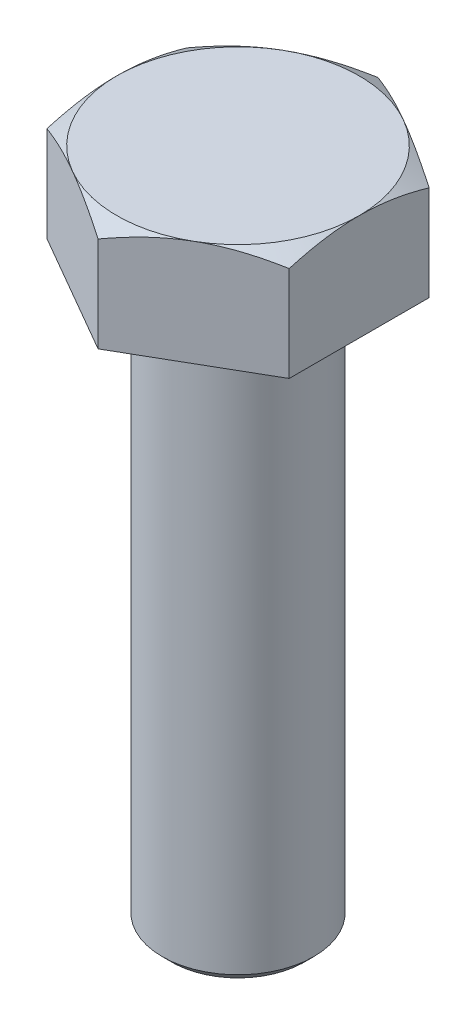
ISO-10303-21;
HEADER;
FILE_DESCRIPTION(('STEP AP214'),'2;1');
FILE_NAME('part.step','',(''),(''),'','','');
FILE_SCHEMA(('AUTOMOTIVE_DESIGN { 1 0 10303 214 1 1 1 1 }'));
ENDSEC;
DATA;
#1=APPLICATION_CONTEXT('core data for automotive mechanical design processes');
#2=APPLICATION_PROTOCOL_DEFINITION('international standard','automotive_design',2000,#1);
#3=PRODUCT_CONTEXT('',#1,'mechanical');
#4=PRODUCT('Part','Part','',(#3));
#5=PRODUCT_RELATED_PRODUCT_CATEGORY('part','',(#4));
#6=PRODUCT_DEFINITION_FORMATION('','',#4);
#7=PRODUCT_DEFINITION_CONTEXT('part definition',#1,'design');
#8=PRODUCT_DEFINITION('design','',#6,#7);
#9=PRODUCT_DEFINITION_SHAPE('','',#8);
#10=(LENGTH_UNIT() NAMED_UNIT(*) SI_UNIT(.MILLI.,.METRE.));
#11=(NAMED_UNIT(*) PLANE_ANGLE_UNIT() SI_UNIT($,.RADIAN.));
#12=(NAMED_UNIT(*) SI_UNIT($,.STERADIAN.) SOLID_ANGLE_UNIT());
#13=UNCERTAINTY_MEASURE_WITH_UNIT(LENGTH_MEASURE(1.E-05),#10,'distance_accuracy_value','');
#14=(GEOMETRIC_REPRESENTATION_CONTEXT(3) GLOBAL_UNCERTAINTY_ASSIGNED_CONTEXT((#13)) GLOBAL_UNIT_ASSIGNED_CONTEXT((#10,
#11,#12)) REPRESENTATION_CONTEXT('',''));
#15=CARTESIAN_POINT('',(0.,0.,0.));
#16=DIRECTION('',(0.,0.,1.));
#17=DIRECTION('',(1.,0.,0.));
#18=AXIS2_PLACEMENT_3D('',#15,#16,#17);
#19=CARTESIAN_POINT('',(0.,-60.,0.));
#20=DIRECTION('',(0.,1.,0.));
#21=DIRECTION('',(0.,0.,1.));
#22=AXIS2_PLACEMENT_3D('',#19,#20,#21);
#23=CYLINDRICAL_SURFACE('',#22,8.);
#24=CARTESIAN_POINT('',(0.,0.,0.));
#25=DIRECTION('',(0.,1.,0.));
#26=DIRECTION('',(0.,0.,1.));
#27=AXIS2_PLACEMENT_3D('',#24,#25,#26);
#28=CIRCLE('',#27,8.);
#29=CARTESIAN_POINT('',(0.,0.,8.));
#30=VERTEX_POINT('',#29);
#31=EDGE_CURVE('E246',#30,#30,#28,.F.);
#32=ORIENTED_EDGE('',*,*,#31,.T.);
#33=EDGE_LOOP('',(#32));
#34=FACE_BOUND('',#33,.T.);
#35=CARTESIAN_POINT('',(0.,-59.,0.));
#36=DIRECTION('',(0.,1.,0.));
#37=DIRECTION('',(0.,0.,1.));
#38=AXIS2_PLACEMENT_3D('',#35,#36,#37);
#39=CIRCLE('',#38,8.);
#40=CARTESIAN_POINT('',(0.,-59.,8.));
#41=VERTEX_POINT('',#40);
#42=EDGE_CURVE('E336',#41,#41,#39,.F.);
#43=ORIENTED_EDGE('',*,*,#42,.F.);
#44=EDGE_LOOP('',(#43));
#45=FACE_BOUND('',#44,.T.);
#46=ADVANCED_FACE('F38',(#34,#45),#23,.T.);
#47=CARTESIAN_POINT('',(12.8,11.2,-7.39008344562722));
#48=DIRECTION('',(-0.5,0.,0.866025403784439));
#49=DIRECTION('',(0.866025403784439,0.,0.5));
#50=AXIS2_PLACEMENT_3D('',#47,#48,#49);
#51=PLANE('',#50);
#52=CARTESIAN_POINT('',(12.8002,10.056683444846,-7.38996797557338));
#53=CARTESIAN_POINT('',(12.5188607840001,10.1504573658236,-7.55239924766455));
#54=CARTESIAN_POINT('',(12.2364241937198,10.2399760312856,-7.71546408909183));
#55=CARTESIAN_POINT('',(11.6692862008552,10.4093200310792,-8.04290136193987));
#56=CARTESIAN_POINT('',(11.3845840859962,10.4891421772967,-8.20727420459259));
#57=CARTESIAN_POINT('',(10.8123648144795,10.6380201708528,-8.53764515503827));
#58=CARTESIAN_POINT('',(10.5248426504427,10.7070505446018,-8.70364615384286));
#59=CARTESIAN_POINT('',(9.94780038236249,10.8328627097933,-9.03680166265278));
#60=CARTESIAN_POINT('',(9.65828039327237,10.8896452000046,-9.20395610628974));
#61=CARTESIAN_POINT('',(9.08466110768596,10.988546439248,-9.53513535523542));
#62=CARTESIAN_POINT('',(8.80060439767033,11.0309925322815,-9.69913557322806));
#63=CARTESIAN_POINT('',(8.23118936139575,11.1021653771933,-10.0278874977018));
#64=CARTESIAN_POINT('',(7.94583101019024,11.1308918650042,-10.1926392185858));
#65=CARTESIAN_POINT('',(7.37463493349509,11.1739001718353,-10.5224194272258));
#66=CARTESIAN_POINT('',(7.08879818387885,11.1881991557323,-10.687447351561));
#67=CARTESIAN_POINT('',(6.51686081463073,11.2020449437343,-11.0176555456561));
#68=CARTESIAN_POINT('',(6.2307602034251,11.2015922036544,-11.1828358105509));
#69=CARTESIAN_POINT('',(5.69589532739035,11.1869648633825,-11.4916401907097));
#70=CARTESIAN_POINT('',(5.44709294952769,11.1745744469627,-11.6352863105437));
#71=CARTESIAN_POINT('',(4.95006049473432,11.1388708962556,-11.9222481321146));
#72=CARTESIAN_POINT('',(4.70183045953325,11.1155569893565,-12.0655638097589));
#73=CARTESIAN_POINT('',(4.20607752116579,11.0584129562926,-12.3517869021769));
#74=CARTESIAN_POINT('',(3.95855537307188,11.0245741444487,-12.4946938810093));
#75=CARTESIAN_POINT('',(3.46467151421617,10.9469740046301,-12.7798378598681));
#76=CARTESIAN_POINT('',(3.21830988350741,10.903212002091,-12.9220748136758));
#77=CARTESIAN_POINT('',(2.47046538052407,10.7559349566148,-13.3538430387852));
#78=CARTESIAN_POINT('',(1.97114815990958,10.6377347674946,-13.642123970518));
#79=CARTESIAN_POINT('',(0.97995921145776,10.3694685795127,-14.2143871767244));
#80=CARTESIAN_POINT('',(0.488074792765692,10.2194655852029,-14.4983767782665));
#81=CARTESIAN_POINT('',(-0.000199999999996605,10.056683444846,-14.7802823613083));
#82=B_SPLINE_CURVE_WITH_KNOTS('',3,(#52,#53,#54,#55,#56,#57,#58,#59,#60,#61,#62,#63,#64,#65,#66,
#67,#68,#69,#70,#71,#72,#73,#74,#75,#76,#77,#78,#79,#80,#81),.UNSPECIFIED.,.F.,.F.,(4,2,2,2,2,2,
2,2,2,2,2,2,2,2,4),(0.,1.01440467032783,2.02914196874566,3.04623948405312,4.06327895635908,
5.05521538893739,6.04717091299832,7.03794487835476,8.02868822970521,8.89115821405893,
9.7536892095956,10.6169339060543,11.4802373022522,13.2448088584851,15.0059167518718),.UNSPECIFIED.);
#83=CARTESIAN_POINT('',(12.8,10.0567501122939,-7.39008344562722));
#84=VERTEX_POINT('',#83);
#85=CARTESIAN_POINT('',(6.40000000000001,11.2,-11.0851251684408));
#86=VERTEX_POINT('',#85);
#87=EDGE_CURVE('E109',#84,#86,#82,.T.);
#88=ORIENTED_EDGE('',*,*,#87,.F.);
#89=DIRECTION('',(0.,-1.,0.));
#90=VECTOR('',#89,1.);
#91=CARTESIAN_POINT('',(12.8,11.2,-7.39008344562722));
#92=LINE('',#91,#90);
#93=CARTESIAN_POINT('',(12.8,0.,-7.39008344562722));
#94=VERTEX_POINT('',#93);
#95=EDGE_CURVE('E241',#84,#94,#92,.T.);
#96=ORIENTED_EDGE('',*,*,#95,.T.);
#97=DIRECTION('',(-0.866025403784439,0.,-0.5));
#98=VECTOR('',#97,1.);
#99=CARTESIAN_POINT('',(12.8,0.,-7.39008344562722));
#100=LINE('',#99,#98);
#101=CARTESIAN_POINT('',(0.,0.,-14.7801668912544));
#102=VERTEX_POINT('',#101);
#103=EDGE_CURVE('E117',#94,#102,#100,.T.);
#104=ORIENTED_EDGE('',*,*,#103,.T.);
#105=DIRECTION('',(0.,-1.,0.));
#106=VECTOR('',#105,1.);
#107=CARTESIAN_POINT('',(0.,11.2,-14.7801668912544));
#108=LINE('',#107,#106);
#109=CARTESIAN_POINT('',(0.,10.0567501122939,-14.7801668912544));
#110=VERTEX_POINT('',#109);
#111=EDGE_CURVE('E132',#110,#102,#108,.T.);
#112=ORIENTED_EDGE('',*,*,#111,.F.);
#113=EDGE_CURVE('E118',#86,#110,#82,.T.);
#114=ORIENTED_EDGE('',*,*,#113,.F.);
#115=EDGE_LOOP('',(#88,#96,#104,#112,#114));
#116=FACE_BOUND('',#115,.T.);
#117=ADVANCED_FACE('F40',(#116),#51,.F.);
#118=CARTESIAN_POINT('',(0.,11.2,-14.7801668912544));
#119=DIRECTION('',(0.5,0.,0.866025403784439));
#120=DIRECTION('',(0.866025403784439,0.,-0.5));
#121=AXIS2_PLACEMENT_3D('',#118,#119,#120);
#122=PLANE('',#121);
#123=CARTESIAN_POINT('',(0.000200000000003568,10.056683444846,-14.7802823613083));
#124=CARTESIAN_POINT('',(-0.281139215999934,10.1504573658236,-14.6178510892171));
#125=CARTESIAN_POINT('',(-0.563575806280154,10.2399760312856,-14.4547862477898));
#126=CARTESIAN_POINT('',(-1.13071379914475,10.4093200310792,-14.1273489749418));
#127=CARTESIAN_POINT('',(-1.41541591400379,10.4891421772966,-13.9629761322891));
#128=CARTESIAN_POINT('',(-1.98763518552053,10.6380201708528,-13.6326051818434));
#129=CARTESIAN_POINT('',(-2.27515734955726,10.7070505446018,-13.4666041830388));
#130=CARTESIAN_POINT('',(-2.85219961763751,10.8328627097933,-13.1334486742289));
#131=CARTESIAN_POINT('',(-3.14171960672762,10.8896452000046,-12.9662942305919));
#132=CARTESIAN_POINT('',(-3.71533889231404,10.988546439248,-12.6351149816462));
#133=CARTESIAN_POINT('',(-3.99939560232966,11.0309925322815,-12.4711147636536));
#134=CARTESIAN_POINT('',(-4.56881063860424,11.1021653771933,-12.1423628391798));
#135=CARTESIAN_POINT('',(-4.85416898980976,11.1308918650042,-11.9776111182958));
#136=CARTESIAN_POINT('',(-5.4253650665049,11.1739001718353,-11.6478309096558));
#137=CARTESIAN_POINT('',(-5.71120181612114,11.1881991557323,-11.4828029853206));
#138=CARTESIAN_POINT('',(-6.28313918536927,11.2020449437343,-11.1525947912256));
#139=CARTESIAN_POINT('',(-6.5692397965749,11.2015922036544,-10.9874145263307));
#140=CARTESIAN_POINT('',(-7.10410467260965,11.1869648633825,-10.678610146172));
#141=CARTESIAN_POINT('',(-7.3529070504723,11.1745744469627,-10.5349640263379));
#142=CARTESIAN_POINT('',(-7.84993950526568,11.1388708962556,-10.248002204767));
#143=CARTESIAN_POINT('',(-8.09816954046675,11.1155569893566,-10.1046865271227));
#144=CARTESIAN_POINT('',(-8.59392247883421,11.0584129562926,-9.81846343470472));
#145=CARTESIAN_POINT('',(-8.84144462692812,11.0245741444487,-9.67555645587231));
#146=CARTESIAN_POINT('',(-9.33532848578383,10.9469740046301,-9.39041247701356));
#147=CARTESIAN_POINT('',(-9.58169011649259,10.903212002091,-9.24817552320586));
#148=CARTESIAN_POINT('',(-10.3295346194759,10.7559349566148,-8.81640729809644));
#149=CARTESIAN_POINT('',(-10.8288518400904,10.6377347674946,-8.52812636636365));
#150=CARTESIAN_POINT('',(-11.8200407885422,10.3694685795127,-7.95586316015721));
#151=CARTESIAN_POINT('',(-12.3119252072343,10.2194655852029,-7.67187355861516));
#152=CARTESIAN_POINT('',(-12.8002,10.056683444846,-7.38996797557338));
#153=B_SPLINE_CURVE_WITH_KNOTS('',3,(#123,#124,#125,#126,#127,#128,#129,#130,#131,#132,#133,
#134,#135,#136,#137,#138,#139,#140,#141,#142,#143,#144,#145,#146,#147,#148,#149,#150,#151,#152),
.UNSPECIFIED.,.F.,.F.,(4,2,2,2,2,2,2,2,2,2,2,2,2,2,4),(0.,1.01440467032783,2.02914196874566,
3.04623948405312,4.06327895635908,5.05521538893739,6.04717091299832,7.03794487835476,
8.02868822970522,8.89115821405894,9.7536892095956,10.6169339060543,11.4802373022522,
13.2448088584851,15.0059167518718),.UNSPECIFIED.);
#154=CARTESIAN_POINT('',(-6.4,11.2,-11.0851251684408));
#155=VERTEX_POINT('',#154);
#156=EDGE_CURVE('E124',#110,#155,#153,.T.);
#157=ORIENTED_EDGE('',*,*,#156,.F.);
#158=ORIENTED_EDGE('',*,*,#111,.T.);
#159=DIRECTION('',(-0.866025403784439,0.,0.5));
#160=VECTOR('',#159,1.);
#161=CARTESIAN_POINT('',(0.,0.,-14.7801668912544));
#162=LINE('',#161,#160);
#163=CARTESIAN_POINT('',(-12.8,0.,-7.39008344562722));
#164=VERTEX_POINT('',#163);
#165=EDGE_CURVE('E281',#102,#164,#162,.T.);
#166=ORIENTED_EDGE('',*,*,#165,.T.);
#167=DIRECTION('',(0.,-1.,0.));
#168=VECTOR('',#167,1.);
#169=CARTESIAN_POINT('',(-12.8,11.2,-7.39008344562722));
#170=LINE('',#169,#168);
#171=CARTESIAN_POINT('',(-12.8,10.0567501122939,-7.39008344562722));
#172=VERTEX_POINT('',#171);
#173=EDGE_CURVE('E239',#172,#164,#170,.T.);
#174=ORIENTED_EDGE('',*,*,#173,.F.);
#175=EDGE_CURVE('E133',#155,#172,#153,.T.);
#176=ORIENTED_EDGE('',*,*,#175,.F.);
#177=EDGE_LOOP('',(#157,#158,#166,#174,#176));
#178=FACE_BOUND('',#177,.T.);
#179=ADVANCED_FACE('F187',(#178),#122,.F.);
#180=CARTESIAN_POINT('',(-12.8,11.2,-7.39008344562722));
#181=DIRECTION('',(1.,0.,0.));
#182=DIRECTION('',(0.,0.,-1.));
#183=AXIS2_PLACEMENT_3D('',#180,#181,#182);
#184=PLANE('',#183);
#185=CARTESIAN_POINT('',(-12.8,4.77136237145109,-20.2245186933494));
#186=CARTESIAN_POINT('',(-12.8,4.90853193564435,-19.9433435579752));
#187=CARTESIAN_POINT('',(-12.8,5.04504514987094,-19.6618483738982));
#188=CARTESIAN_POINT('',(-12.8,5.31661090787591,-19.0981512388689));
#189=CARTESIAN_POINT('',(-12.8,5.45166343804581,-18.815949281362));
#190=CARTESIAN_POINT('',(-12.8,5.85444132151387,-17.9681130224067));
#191=CARTESIAN_POINT('',(-12.8,6.11974898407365,-17.4013259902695));
#192=CARTESIAN_POINT('',(-12.8,6.6437309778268,-16.2611725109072));
#193=CARTESIAN_POINT('',(-12.8,6.9023644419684,-15.6877872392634));
#194=CARTESIAN_POINT('',(-12.8,7.40953712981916,-14.5365849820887));
#195=CARTESIAN_POINT('',(-12.8,7.658076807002,-13.9587681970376));
#196=CARTESIAN_POINT('',(-12.8,8.15070199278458,-12.7778898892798));
#197=CARTESIAN_POINT('',(-12.8,8.39434282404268,-12.1746419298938));
#198=CARTESIAN_POINT('',(-12.8,8.86407470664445,-10.9612240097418));
#199=CARTESIAN_POINT('',(-12.8,9.09016384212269,-10.3510533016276));
#200=CARTESIAN_POINT('',(-12.8,9.5191263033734,-9.12386364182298));
#201=CARTESIAN_POINT('',(-12.8,9.72204353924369,-8.50686015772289));
#202=CARTESIAN_POINT('',(-12.8,10.0984134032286,-7.26395430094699));
#203=CARTESIAN_POINT('',(-12.8,10.2718749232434,-6.63805467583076));
#204=CARTESIAN_POINT('',(-12.8,10.5034178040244,-5.69411002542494));
#205=CARTESIAN_POINT('',(-12.8,10.5756577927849,-5.37951938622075));
#206=CARTESIAN_POINT('',(-12.8,10.7097601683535,-4.74812252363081));
#207=CARTESIAN_POINT('',(-12.8,10.7716227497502,-4.43131634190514));
#208=CARTESIAN_POINT('',(-12.8,10.8839027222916,-3.79568029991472));
#209=CARTESIAN_POINT('',(-12.8,10.9343204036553,-3.47685049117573));
#210=CARTESIAN_POINT('',(-12.8,11.0227204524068,-2.83747440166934));
#211=CARTESIAN_POINT('',(-12.8,11.060703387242,-2.5169281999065));
#212=CARTESIAN_POINT('',(-12.8,11.1229817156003,-1.87891269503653));
#213=CARTESIAN_POINT('',(-12.8,11.1474566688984,-1.56146102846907));
#214=CARTESIAN_POINT('',(-12.8,11.1829459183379,-0.925806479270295));
#215=CARTESIAN_POINT('',(-12.8,11.1939604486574,-0.607603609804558));
#216=CARTESIAN_POINT('',(-12.8,11.202264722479,0.0289859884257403));
#217=CARTESIAN_POINT('',(-12.8,11.1995544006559,0.347372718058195));
#218=CARTESIAN_POINT('',(-12.8,11.1804789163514,0.983740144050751));
#219=CARTESIAN_POINT('',(-12.8,11.1641131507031,1.30172082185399));
#220=CARTESIAN_POINT('',(-12.8,11.1095404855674,2.05476733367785));
#221=CARTESIAN_POINT('',(-12.8,11.0654761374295,2.48941866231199));
#222=CARTESIAN_POINT('',(-12.8,10.9541541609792,3.3557168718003));
#223=CARTESIAN_POINT('',(-12.8,10.8868936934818,3.78736337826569));
#224=CARTESIAN_POINT('',(-12.8,10.65386684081,5.07716556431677));
#225=CARTESIAN_POINT('',(-12.8,10.4568892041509,5.92976949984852));
#226=CARTESIAN_POINT('',(-12.8,10.1124257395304,7.20541888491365));
#227=CARTESIAN_POINT('',(-12.8,9.98771455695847,7.63499671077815));
#228=CARTESIAN_POINT('',(-12.8,9.72462356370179,8.4899878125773));
#229=CARTESIAN_POINT('',(-12.8,9.58624364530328,8.91540105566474));
#230=CARTESIAN_POINT('',(-12.8,9.29809238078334,9.76218661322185));
#231=CARTESIAN_POINT('',(-12.8,9.1483241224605,10.1835599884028));
#232=CARTESIAN_POINT('',(-12.8,8.83923679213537,11.0227686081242));
#233=CARTESIAN_POINT('',(-12.8,8.67991795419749,11.4406039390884));
#234=CARTESIAN_POINT('',(-12.8,8.37440796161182,12.2192775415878));
#235=CARTESIAN_POINT('',(-12.8,8.22918453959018,12.5804970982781));
#236=CARTESIAN_POINT('',(-12.8,7.93351836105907,13.300796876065));
#237=CARTESIAN_POINT('',(-12.8,7.78307551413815,13.6598770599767));
#238=CARTESIAN_POINT('',(-12.8,7.32500384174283,14.7343153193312));
#239=CARTESIAN_POINT('',(-12.8,7.01065605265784,15.4468102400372));
#240=CARTESIAN_POINT('',(-12.8,6.36841606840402,16.8659788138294));
#241=CARTESIAN_POINT('',(-12.8,6.04051837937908,17.5726499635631));
#242=CARTESIAN_POINT('',(-12.8,5.37445440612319,18.9810869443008));
#243=CARTESIAN_POINT('',(-12.8,5.03628857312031,19.6828529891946));
#244=CARTESIAN_POINT('',(-12.8,4.35138875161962,21.0836458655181));
#245=CARTESIAN_POINT('',(-12.8,4.00464129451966,21.7826660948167));
#246=CARTESIAN_POINT('',(-12.8,3.30480864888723,23.1775295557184));
#247=CARTESIAN_POINT('',(-12.8,2.95172340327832,23.8733727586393));
#248=CARTESIAN_POINT('',(-12.8,2.24056060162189,25.2622961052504));
#249=CARTESIAN_POINT('',(-12.8,1.88248422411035,25.9553768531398));
#250=CARTESIAN_POINT('',(-12.8,1.16220813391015,27.3393871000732));
#251=CARTESIAN_POINT('',(-12.8,0.80000843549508,28.0303166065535));
#252=CARTESIAN_POINT('',(-12.8,-0.212633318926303,29.9505983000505));
#253=CARTESIAN_POINT('',(-12.8,-0.866748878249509,31.1780128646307));
#254=CARTESIAN_POINT('',(-12.8,-2.18275107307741,33.6287636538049));
#255=CARTESIAN_POINT('',(-12.8,-2.84463821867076,34.8520996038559));
#256=CARTESIAN_POINT('',(-12.8,-4.17187494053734,37.291365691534));
#257=CARTESIAN_POINT('',(-12.8,-4.8372044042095,38.5073067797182));
#258=CARTESIAN_POINT('',(-12.8,-5.83846787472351,40.3293545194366));
#259=CARTESIAN_POINT('',(-12.8,-6.17275344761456,40.9363682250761));
#260=CARTESIAN_POINT('',(-12.8,-6.84230078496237,42.1498560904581));
#261=CARTESIAN_POINT('',(-12.8,-7.1775625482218,42.7563302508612));
#262=CARTESIAN_POINT('',(-12.8,-7.51325155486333,43.3625678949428));
#263=B_SPLINE_CURVE_WITH_KNOTS('',3,(#185,#186,#187,#188,#189,#190,#191,#192,#193,#194,#195,
#196,#197,#198,#199,#200,#201,#202,#203,#204,#205,#206,#207,#208,#209,#210,#211,#212,#213,#214,
#215,#216,#217,#218,#219,#220,#221,#222,#223,#224,#225,#226,#227,#228,#229,#230,#231,#232,#233,
#234,#235,#236,#237,#238,#239,#240,#241,#242,#243,#244,#245,#246,#247,#248,#249,#250,#251,#252,
#253,#254,#255,#256,#257,#258,#259,#260,#261,#262),.UNSPECIFIED.,.F.,.F.,(4,2,2,2,2,2,2,2,2,2,2,
2,2,2,2,2,2,2,2,2,2,2,2,2,2,2,2,2,2,2,2,2,2,2,2,2,2,2,4),(0.,0.938547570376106,1.87710387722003,
3.7544758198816,5.64144976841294,7.52833884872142,9.47990389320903,11.4316816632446,
13.379697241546,15.3271237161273,16.2953154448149,17.2634890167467,18.2316380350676,
19.1997428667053,20.1546482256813,21.1095369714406,22.0644302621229,23.0193657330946,
24.3292712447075,25.6393371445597,28.2607107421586,29.6025307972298,30.9443614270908,
32.2858295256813,33.6272647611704,34.7951773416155,35.9631101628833,38.2991721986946,
40.6361908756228,42.9731070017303,45.3139581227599,47.6548303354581,49.9951588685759,
52.3354793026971,56.5079317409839,60.6806595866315,64.8388417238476,66.917762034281,
68.9966797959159),.UNSPECIFIED.);
#264=CARTESIAN_POINT('',(-12.8,11.2,0.));
#265=VERTEX_POINT('',#264);
#266=EDGE_CURVE('E181',#172,#265,#263,.T.);
#267=ORIENTED_EDGE('',*,*,#266,.F.);
#268=ORIENTED_EDGE('',*,*,#173,.T.);
#269=DIRECTION('',(0.,0.,1.));
#270=VECTOR('',#269,1.);
#271=CARTESIAN_POINT('',(-12.8,0.,-7.39008344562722));
#272=LINE('',#271,#270);
#273=CARTESIAN_POINT('',(-12.8,0.,7.39008344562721));
#274=VERTEX_POINT('',#273);
#275=EDGE_CURVE('E280',#164,#274,#272,.T.);
#276=ORIENTED_EDGE('',*,*,#275,.T.);
#277=DIRECTION('',(0.,-1.,0.));
#278=VECTOR('',#277,1.);
#279=CARTESIAN_POINT('',(-12.8,11.2,7.39008344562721));
#280=LINE('',#279,#278);
#281=CARTESIAN_POINT('',(-12.8,10.0567501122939,7.39008344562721));
#282=VERTEX_POINT('',#281);
#283=EDGE_CURVE('E236',#282,#274,#280,.T.);
#284=ORIENTED_EDGE('',*,*,#283,.F.);
#285=EDGE_CURVE('E176',#265,#282,#263,.T.);
#286=ORIENTED_EDGE('',*,*,#285,.F.);
#287=EDGE_LOOP('',(#267,#268,#276,#284,#286));
#288=FACE_BOUND('',#287,.T.);
#289=ADVANCED_FACE('F183',(#288),#184,.F.);
#290=CARTESIAN_POINT('',(-12.8,11.2,7.39008344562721));
#291=DIRECTION('',(0.5,0.,-0.866025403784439));
#292=DIRECTION('',(-0.866025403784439,0.,-0.5));
#293=AXIS2_PLACEMENT_3D('',#290,#291,#292);
#294=PLANE('',#293);
#295=CARTESIAN_POINT('',(-12.8002,10.056683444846,7.38996797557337));
#296=CARTESIAN_POINT('',(-12.5188607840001,10.1504573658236,7.55239924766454));
#297=CARTESIAN_POINT('',(-12.2364241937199,10.2399760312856,7.71546408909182));
#298=CARTESIAN_POINT('',(-11.6692862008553,10.4093200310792,8.04290136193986));
#299=CARTESIAN_POINT('',(-11.3845840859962,10.4891421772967,8.20727420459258));
#300=CARTESIAN_POINT('',(-10.8123648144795,10.6380201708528,8.53764515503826));
#301=CARTESIAN_POINT('',(-10.5248426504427,10.7070505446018,8.70364615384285));
#302=CARTESIAN_POINT('',(-9.9478003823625,10.8328627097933,9.03680166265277));
#303=CARTESIAN_POINT('',(-9.65828039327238,10.8896452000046,9.20395610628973));
#304=CARTESIAN_POINT('',(-9.08466110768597,10.988546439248,9.53513535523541));
#305=CARTESIAN_POINT('',(-8.80060439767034,11.0309925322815,9.69913557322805));
#306=CARTESIAN_POINT('',(-8.23118936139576,11.1021653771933,10.0278874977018));
#307=CARTESIAN_POINT('',(-7.94583101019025,11.1308918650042,10.1926392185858));
#308=CARTESIAN_POINT('',(-7.3746349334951,11.1739001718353,10.5224194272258));
#309=CARTESIAN_POINT('',(-7.08879818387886,11.1881991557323,10.687447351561));
#310=CARTESIAN_POINT('',(-6.51686081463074,11.2020449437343,11.017655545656));
#311=CARTESIAN_POINT('',(-6.23076020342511,11.2015922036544,11.1828358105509));
#312=CARTESIAN_POINT('',(-5.69589532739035,11.1869648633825,11.4916401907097));
#313=CARTESIAN_POINT('',(-5.4470929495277,11.1745744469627,11.6352863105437));
#314=CARTESIAN_POINT('',(-4.95006049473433,11.1388708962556,11.9222481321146));
#315=CARTESIAN_POINT('',(-4.70183045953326,11.1155569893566,12.0655638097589));
#316=CARTESIAN_POINT('',(-4.2060775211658,11.0584129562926,12.3517869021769));
#317=CARTESIAN_POINT('',(-3.95855537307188,11.0245741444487,12.4946938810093));
#318=CARTESIAN_POINT('',(-3.46467151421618,10.9469740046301,12.7798378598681));
#319=CARTESIAN_POINT('',(-3.21830988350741,10.903212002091,12.9220748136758));
#320=CARTESIAN_POINT('',(-2.47046538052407,10.7559349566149,13.3538430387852));
#321=CARTESIAN_POINT('',(-1.97114815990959,10.6377347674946,13.642123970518));
#322=CARTESIAN_POINT('',(-0.979959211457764,10.3694685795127,14.2143871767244));
#323=CARTESIAN_POINT('',(-0.488074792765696,10.2194655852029,14.4983767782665));
#324=CARTESIAN_POINT('',(0.000199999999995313,10.056683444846,14.7802823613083));
#325=B_SPLINE_CURVE_WITH_KNOTS('',3,(#295,#296,#297,#298,#299,#300,#301,#302,#303,#304,#305,
#306,#307,#308,#309,#310,#311,#312,#313,#314,#315,#316,#317,#318,#319,#320,#321,#322,#323,#324),
.UNSPECIFIED.,.F.,.F.,(4,2,2,2,2,2,2,2,2,2,2,2,2,2,4),(0.,1.01440467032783,2.02914196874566,
3.04623948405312,4.06327895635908,5.05521538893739,6.04717091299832,7.03794487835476,
8.02868822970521,8.89115821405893,9.7536892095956,10.6169339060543,11.4802373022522,
13.2448088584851,15.0059167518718),.UNSPECIFIED.);
#326=CARTESIAN_POINT('',(-6.40000000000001,11.2,11.0851251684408));
#327=VERTEX_POINT('',#326);
#328=EDGE_CURVE('E182',#282,#327,#325,.T.);
#329=ORIENTED_EDGE('',*,*,#328,.F.);
#330=ORIENTED_EDGE('',*,*,#283,.T.);
#331=DIRECTION('',(0.866025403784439,0.,0.5));
#332=VECTOR('',#331,1.);
#333=CARTESIAN_POINT('',(-12.8,0.,7.39008344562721));
#334=LINE('',#333,#332);
#335=CARTESIAN_POINT('',(0.,0.,14.7801668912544));
#336=VERTEX_POINT('',#335);
#337=EDGE_CURVE('E234',#274,#336,#334,.T.);
#338=ORIENTED_EDGE('',*,*,#337,.T.);
#339=DIRECTION('',(0.,-1.,0.));
#340=VECTOR('',#339,1.);
#341=CARTESIAN_POINT('',(0.,11.2,14.7801668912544));
#342=LINE('',#341,#340);
#343=CARTESIAN_POINT('',(0.,10.0567501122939,14.7801668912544));
#344=VERTEX_POINT('',#343);
#345=EDGE_CURVE('E226',#344,#336,#342,.T.);
#346=ORIENTED_EDGE('',*,*,#345,.F.);
#347=EDGE_CURVE('E171',#327,#344,#325,.T.);
#348=ORIENTED_EDGE('',*,*,#347,.F.);
#349=EDGE_LOOP('',(#329,#330,#338,#346,#348));
#350=FACE_BOUND('',#349,.T.);
#351=ADVANCED_FACE('F186',(#350),#294,.F.);
#352=CARTESIAN_POINT('',(0.,11.2,14.7801668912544));
#353=DIRECTION('',(-0.5,0.,-0.866025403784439));
#354=DIRECTION('',(-0.866025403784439,0.,0.5));
#355=AXIS2_PLACEMENT_3D('',#352,#353,#354);
#356=PLANE('',#355);
#357=CARTESIAN_POINT('',(-0.00020000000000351,10.056683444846,14.7802823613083));
#358=CARTESIAN_POINT('',(0.281139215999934,10.1504573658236,14.6178510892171));
#359=CARTESIAN_POINT('',(0.563575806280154,10.2399760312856,14.4547862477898));
#360=CARTESIAN_POINT('',(1.13071379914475,10.4093200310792,14.1273489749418));
#361=CARTESIAN_POINT('',(1.41541591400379,10.4891421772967,13.9629761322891));
#362=CARTESIAN_POINT('',(1.98763518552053,10.6380201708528,13.6326051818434));
#363=CARTESIAN_POINT('',(2.27515734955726,10.7070505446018,13.4666041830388));
#364=CARTESIAN_POINT('',(2.8521996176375,10.8328627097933,13.1334486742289));
#365=CARTESIAN_POINT('',(3.14171960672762,10.8896452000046,12.9662942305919));
#366=CARTESIAN_POINT('',(3.71533889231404,10.988546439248,12.6351149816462));
#367=CARTESIAN_POINT('',(3.99939560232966,11.0309925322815,12.4711147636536));
#368=CARTESIAN_POINT('',(4.56881063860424,11.1021653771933,12.1423628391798));
#369=CARTESIAN_POINT('',(4.85416898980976,11.1308918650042,11.9776111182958));
#370=CARTESIAN_POINT('',(5.4253650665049,11.1739001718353,11.6478309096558));
#371=CARTESIAN_POINT('',(5.71120181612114,11.1881991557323,11.4828029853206));
#372=CARTESIAN_POINT('',(6.28313918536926,11.2020449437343,11.1525947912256));
#373=CARTESIAN_POINT('',(6.5692397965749,11.2015922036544,10.9874145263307));
#374=CARTESIAN_POINT('',(7.10410467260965,11.1869648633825,10.678610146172));
#375=CARTESIAN_POINT('',(7.3529070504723,11.1745744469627,10.5349640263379));
#376=CARTESIAN_POINT('',(7.84993950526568,11.1388708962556,10.248002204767));
#377=CARTESIAN_POINT('',(8.09816954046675,11.1155569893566,10.1046865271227));
#378=CARTESIAN_POINT('',(8.59392247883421,11.0584129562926,9.81846343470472));
#379=CARTESIAN_POINT('',(8.84144462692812,11.0245741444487,9.6755564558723));
#380=CARTESIAN_POINT('',(9.33532848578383,10.9469740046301,9.39041247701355));
#381=CARTESIAN_POINT('',(9.58169011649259,10.903212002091,9.24817552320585));
#382=CARTESIAN_POINT('',(10.3295346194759,10.7559349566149,8.81640729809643));
#383=CARTESIAN_POINT('',(10.8288518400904,10.6377347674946,8.52812636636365));
#384=CARTESIAN_POINT('',(11.8200407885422,10.3694685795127,7.9558631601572));
#385=CARTESIAN_POINT('',(12.3119252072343,10.2194655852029,7.67187355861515));
#386=CARTESIAN_POINT('',(12.8002,10.056683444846,7.38996797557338));
#387=B_SPLINE_CURVE_WITH_KNOTS('',3,(#357,#358,#359,#360,#361,#362,#363,#364,#365,#366,#367,
#368,#369,#370,#371,#372,#373,#374,#375,#376,#377,#378,#379,#380,#381,#382,#383,#384,#385,#386),
.UNSPECIFIED.,.F.,.F.,(4,2,2,2,2,2,2,2,2,2,2,2,2,2,4),(0.,1.01440467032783,2.02914196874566,
3.04623948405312,4.06327895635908,5.05521538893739,6.04717091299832,7.03794487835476,
8.02868822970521,8.89115821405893,9.7536892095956,10.6169339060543,11.4802373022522,
13.2448088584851,15.0059167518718),.UNSPECIFIED.);
#388=CARTESIAN_POINT('',(6.4,11.2,11.0851251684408));
#389=VERTEX_POINT('',#388);
#390=EDGE_CURVE('E223',#344,#389,#387,.T.);
#391=ORIENTED_EDGE('',*,*,#390,.F.);
#392=ORIENTED_EDGE('',*,*,#345,.T.);
#393=DIRECTION('',(0.866025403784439,0.,-0.5));
#394=VECTOR('',#393,1.);
#395=CARTESIAN_POINT('',(0.,0.,14.7801668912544));
#396=LINE('',#395,#394);
#397=CARTESIAN_POINT('',(12.8,0.,7.39008344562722));
#398=VERTEX_POINT('',#397);
#399=EDGE_CURVE('E270',#336,#398,#396,.T.);
#400=ORIENTED_EDGE('',*,*,#399,.T.);
#401=DIRECTION('',(0.,-1.,0.));
#402=VECTOR('',#401,1.);
#403=CARTESIAN_POINT('',(12.8,11.2,7.39008344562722));
#404=LINE('',#403,#402);
#405=CARTESIAN_POINT('',(12.8,10.0567501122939,7.39008344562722));
#406=VERTEX_POINT('',#405);
#407=EDGE_CURVE('E237',#406,#398,#404,.T.);
#408=ORIENTED_EDGE('',*,*,#407,.F.);
#409=EDGE_CURVE('E165',#389,#406,#387,.T.);
#410=ORIENTED_EDGE('',*,*,#409,.F.);
#411=EDGE_LOOP('',(#391,#392,#400,#408,#410));
#412=FACE_BOUND('',#411,.T.);
#413=ADVANCED_FACE('F212',(#412),#356,.F.);
#414=CARTESIAN_POINT('',(12.8,11.2,7.39008344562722));
#415=DIRECTION('',(-1.,0.,0.));
#416=DIRECTION('',(0.,0.,1.));
#417=AXIS2_PLACEMENT_3D('',#414,#415,#416);
#418=PLANE('',#417);
#419=CARTESIAN_POINT('',(12.8,4.7713623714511,-20.2245186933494));
#420=CARTESIAN_POINT('',(12.8,4.90853193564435,-19.9433435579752));
#421=CARTESIAN_POINT('',(12.8,5.04504514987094,-19.6618483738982));
#422=CARTESIAN_POINT('',(12.8,5.31661090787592,-19.0981512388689));
#423=CARTESIAN_POINT('',(12.8,5.45166343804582,-18.815949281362));
#424=CARTESIAN_POINT('',(12.8,5.85444132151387,-17.9681130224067));
#425=CARTESIAN_POINT('',(12.8,6.11974898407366,-17.4013259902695));
#426=CARTESIAN_POINT('',(12.8,6.6437309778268,-16.2611725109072));
#427=CARTESIAN_POINT('',(12.8,6.90236444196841,-15.6877872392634));
#428=CARTESIAN_POINT('',(12.8,7.40953712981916,-14.5365849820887));
#429=CARTESIAN_POINT('',(12.8,7.65807680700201,-13.9587681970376));
#430=CARTESIAN_POINT('',(12.8,8.15070199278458,-12.7778898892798));
#431=CARTESIAN_POINT('',(12.8,8.39434282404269,-12.1746419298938));
#432=CARTESIAN_POINT('',(12.8,8.86407470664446,-10.9612240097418));
#433=CARTESIAN_POINT('',(12.8,9.0901638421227,-10.3510533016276));
#434=CARTESIAN_POINT('',(12.8,9.51912630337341,-9.12386364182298));
#435=CARTESIAN_POINT('',(12.8,9.72204353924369,-8.50686015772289));
#436=CARTESIAN_POINT('',(12.8,10.0984134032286,-7.26395430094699));
#437=CARTESIAN_POINT('',(12.8,10.2718749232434,-6.63805467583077));
#438=CARTESIAN_POINT('',(12.8,10.5034178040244,-5.69411002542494));
#439=CARTESIAN_POINT('',(12.8,10.5756577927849,-5.37951938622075));
#440=CARTESIAN_POINT('',(12.8,10.7097601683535,-4.74812252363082));
#441=CARTESIAN_POINT('',(12.8,10.7716227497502,-4.43131634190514));
#442=CARTESIAN_POINT('',(12.8,10.8839027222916,-3.79568029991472));
#443=CARTESIAN_POINT('',(12.8,10.9343204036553,-3.47685049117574));
#444=CARTESIAN_POINT('',(12.8,11.0227204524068,-2.83747440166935));
#445=CARTESIAN_POINT('',(12.8,11.060703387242,-2.5169281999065));
#446=CARTESIAN_POINT('',(12.8,11.1229817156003,-1.87891269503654));
#447=CARTESIAN_POINT('',(12.8,11.1474566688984,-1.56146102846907));
#448=CARTESIAN_POINT('',(12.8,11.1829459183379,-0.925806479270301));
#449=CARTESIAN_POINT('',(12.8,11.1939604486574,-0.607603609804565));
#450=CARTESIAN_POINT('',(12.8,11.202264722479,0.0289859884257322));
#451=CARTESIAN_POINT('',(12.8,11.1995544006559,0.347372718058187));
#452=CARTESIAN_POINT('',(12.8,11.1804789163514,0.983740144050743));
#453=CARTESIAN_POINT('',(12.8,11.1641131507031,1.30172082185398));
#454=CARTESIAN_POINT('',(12.8,11.1095404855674,2.05476733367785));
#455=CARTESIAN_POINT('',(12.8,11.0654761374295,2.48941866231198));
#456=CARTESIAN_POINT('',(12.8,10.9541541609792,3.35571687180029));
#457=CARTESIAN_POINT('',(12.8,10.8868936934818,3.78736337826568));
#458=CARTESIAN_POINT('',(12.8,10.65386684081,5.07716556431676));
#459=CARTESIAN_POINT('',(12.8,10.4568892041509,5.92976949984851));
#460=CARTESIAN_POINT('',(12.8,10.1124257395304,7.20541888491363));
#461=CARTESIAN_POINT('',(12.8,9.98771455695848,7.63499671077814));
#462=CARTESIAN_POINT('',(12.8,9.7246235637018,8.48998781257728));
#463=CARTESIAN_POINT('',(12.8,9.58624364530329,8.91540105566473));
#464=CARTESIAN_POINT('',(12.8,9.29809238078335,9.76218661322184));
#465=CARTESIAN_POINT('',(12.8,9.14832412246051,10.1835599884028));
#466=CARTESIAN_POINT('',(12.8,8.83923679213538,11.0227686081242));
#467=CARTESIAN_POINT('',(12.8,8.6799179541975,11.4406039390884));
#468=CARTESIAN_POINT('',(12.8,8.37440796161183,12.2192775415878));
#469=CARTESIAN_POINT('',(12.8,8.22918453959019,12.5804970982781));
#470=CARTESIAN_POINT('',(12.8,7.93351836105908,13.300796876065));
#471=CARTESIAN_POINT('',(12.8,7.78307551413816,13.6598770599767));
#472=CARTESIAN_POINT('',(12.8,7.32500384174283,14.7343153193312));
#473=CARTESIAN_POINT('',(12.8,7.01065605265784,15.4468102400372));
#474=CARTESIAN_POINT('',(12.8,6.36841606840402,16.8659788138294));
#475=CARTESIAN_POINT('',(12.8,6.04051837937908,17.5726499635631));
#476=CARTESIAN_POINT('',(12.8,5.3744544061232,18.9810869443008));
#477=CARTESIAN_POINT('',(12.8,5.03628857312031,19.6828529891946));
#478=CARTESIAN_POINT('',(12.8,4.35138875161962,21.0836458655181));
#479=CARTESIAN_POINT('',(12.8,4.00464129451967,21.7826660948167));
#480=CARTESIAN_POINT('',(12.8,3.30480864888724,23.1775295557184));
#481=CARTESIAN_POINT('',(12.8,2.95172340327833,23.8733727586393));
#482=CARTESIAN_POINT('',(12.8,2.24056060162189,25.2622961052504));
#483=CARTESIAN_POINT('',(12.8,1.88248422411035,25.9553768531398));
#484=CARTESIAN_POINT('',(12.8,1.16220813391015,27.3393871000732));
#485=CARTESIAN_POINT('',(12.8,0.800008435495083,28.0303166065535));
#486=CARTESIAN_POINT('',(12.8,-0.2126333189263,29.9505983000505));
#487=CARTESIAN_POINT('',(12.8,-0.866748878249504,31.1780128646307));
#488=CARTESIAN_POINT('',(12.8,-2.1827510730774,33.6287636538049));
#489=CARTESIAN_POINT('',(12.8,-2.84463821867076,34.8520996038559));
#490=CARTESIAN_POINT('',(12.8,-4.17187494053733,37.291365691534));
#491=CARTESIAN_POINT('',(12.8,-4.83720440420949,38.5073067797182));
#492=CARTESIAN_POINT('',(12.8,-5.8384678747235,40.3293545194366));
#493=CARTESIAN_POINT('',(12.8,-6.17275344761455,40.9363682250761));
#494=CARTESIAN_POINT('',(12.8,-6.84230078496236,42.1498560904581));
#495=CARTESIAN_POINT('',(12.8,-7.1775625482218,42.7563302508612));
#496=CARTESIAN_POINT('',(12.8,-7.51325155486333,43.3625678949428));
#497=B_SPLINE_CURVE_WITH_KNOTS('',3,(#419,#420,#421,#422,#423,#424,#425,#426,#427,#428,#429,
#430,#431,#432,#433,#434,#435,#436,#437,#438,#439,#440,#441,#442,#443,#444,#445,#446,#447,#448,
#449,#450,#451,#452,#453,#454,#455,#456,#457,#458,#459,#460,#461,#462,#463,#464,#465,#466,#467,
#468,#469,#470,#471,#472,#473,#474,#475,#476,#477,#478,#479,#480,#481,#482,#483,#484,#485,#486,
#487,#488,#489,#490,#491,#492,#493,#494,#495,#496),.UNSPECIFIED.,.F.,.F.,(4,2,2,2,2,2,2,2,2,2,2,
2,2,2,2,2,2,2,2,2,2,2,2,2,2,2,2,2,2,2,2,2,2,2,2,2,2,2,4),(0.,0.938547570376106,1.87710387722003,
3.7544758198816,5.64144976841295,7.52833884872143,9.47990389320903,11.4316816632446,
13.379697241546,15.3271237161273,16.2953154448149,17.2634890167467,18.2316380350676,
19.1997428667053,20.1546482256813,21.1095369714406,22.0644302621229,23.0193657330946,
24.3292712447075,25.6393371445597,28.2607107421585,29.6025307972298,30.9443614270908,
32.2858295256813,33.6272647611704,34.7951773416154,35.9631101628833,38.2991721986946,
40.6361908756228,42.9731070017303,45.3139581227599,47.6548303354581,49.9951588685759,
52.3354793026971,56.5079317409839,60.6806595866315,64.8388417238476,66.917762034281,
68.9966797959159),.UNSPECIFIED.);
#498=CARTESIAN_POINT('',(12.8,11.2,0.));
#499=VERTEX_POINT('',#498);
#500=EDGE_CURVE('E268',#406,#499,#497,.F.);
#501=ORIENTED_EDGE('',*,*,#500,.F.);
#502=ORIENTED_EDGE('',*,*,#407,.T.);
#503=DIRECTION('',(0.,0.,-1.));
#504=VECTOR('',#503,1.);
#505=CARTESIAN_POINT('',(12.8,0.,7.39008344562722));
#506=LINE('',#505,#504);
#507=EDGE_CURVE('E273',#398,#94,#506,.T.);
#508=ORIENTED_EDGE('',*,*,#507,.T.);
#509=ORIENTED_EDGE('',*,*,#95,.F.);
#510=EDGE_CURVE('E113',#499,#84,#497,.F.);
#511=ORIENTED_EDGE('',*,*,#510,.F.);
#512=EDGE_LOOP('',(#501,#502,#508,#509,#511));
#513=FACE_BOUND('',#512,.T.);
#514=ADVANCED_FACE('F208',(#513),#418,.F.);
#515=CARTESIAN_POINT('',(0.,0.,0.));
#516=DIRECTION('',(0.,1.,0.));
#517=DIRECTION('',(0.,0.,1.));
#518=AXIS2_PLACEMENT_3D('',#515,#516,#517);
#519=PLANE('',#518);
#520=ORIENTED_EDGE('',*,*,#31,.F.);
#521=EDGE_LOOP('',(#520));
#522=FACE_BOUND('',#521,.T.);
#523=ORIENTED_EDGE('',*,*,#103,.F.);
#524=ORIENTED_EDGE('',*,*,#507,.F.);
#525=ORIENTED_EDGE('',*,*,#399,.F.);
#526=ORIENTED_EDGE('',*,*,#337,.F.);
#527=ORIENTED_EDGE('',*,*,#275,.F.);
#528=ORIENTED_EDGE('',*,*,#165,.F.);
#529=EDGE_LOOP('',(#523,#524,#525,#526,#527,#528));
#530=FACE_BOUND('',#529,.T.);
#531=ADVANCED_FACE('F205',(#522,#530),#519,.F.);
#532=CARTESIAN_POINT('',(0.,11.2,0.));
#533=DIRECTION('',(0.,-1.,0.));
#534=DIRECTION('',(0.,0.,1.));
#535=AXIS2_PLACEMENT_3D('',#532,#533,#534);
#536=CONICAL_SURFACE('',#535,12.8,1.0471975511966);
#537=ORIENTED_EDGE('',*,*,#347,.T.);
#538=ORIENTED_EDGE('',*,*,#390,.T.);
#539=CARTESIAN_POINT('',(0.,11.2,0.));
#540=DIRECTION('',(0.,1.,0.));
#541=DIRECTION('',(0.,0.,1.));
#542=AXIS2_PLACEMENT_3D('',#539,#540,#541);
#543=CIRCLE('',#542,12.8);
#544=EDGE_CURVE('E43',#327,#389,#543,.T.);
#545=ORIENTED_EDGE('',*,*,#544,.F.);
#546=EDGE_LOOP('',(#537,#538,#545));
#547=FACE_BOUND('',#546,.T.);
#548=ADVANCED_FACE('F207',(#547),#536,.T.);
#549=ORIENTED_EDGE('',*,*,#285,.T.);
#550=ORIENTED_EDGE('',*,*,#328,.T.);
#551=EDGE_CURVE('E248',#265,#327,#543,.T.);
#552=ORIENTED_EDGE('',*,*,#551,.F.);
#553=EDGE_LOOP('',(#549,#550,#552));
#554=FACE_BOUND('',#553,.T.);
#555=ADVANCED_FACE('F258',(#554),#536,.T.);
#556=ORIENTED_EDGE('',*,*,#175,.T.);
#557=ORIENTED_EDGE('',*,*,#266,.T.);
#558=EDGE_CURVE('E128',#155,#265,#543,.T.);
#559=ORIENTED_EDGE('',*,*,#558,.F.);
#560=EDGE_LOOP('',(#556,#557,#559));
#561=FACE_BOUND('',#560,.T.);
#562=ADVANCED_FACE('F263',(#561),#536,.T.);
#563=ORIENTED_EDGE('',*,*,#113,.T.);
#564=ORIENTED_EDGE('',*,*,#156,.T.);
#565=EDGE_CURVE('E48',#86,#155,#543,.T.);
#566=ORIENTED_EDGE('',*,*,#565,.F.);
#567=EDGE_LOOP('',(#563,#564,#566));
#568=FACE_BOUND('',#567,.T.);
#569=ADVANCED_FACE('F122',(#568),#536,.T.);
#570=ORIENTED_EDGE('',*,*,#87,.T.);
#571=EDGE_CURVE('E12',#499,#86,#543,.T.);
#572=ORIENTED_EDGE('',*,*,#571,.F.);
#573=ORIENTED_EDGE('',*,*,#510,.T.);
#574=EDGE_LOOP('',(#570,#572,#573));
#575=FACE_BOUND('',#574,.T.);
#576=ADVANCED_FACE('F111',(#575),#536,.T.);
#577=ORIENTED_EDGE('',*,*,#409,.T.);
#578=ORIENTED_EDGE('',*,*,#500,.T.);
#579=CARTESIAN_POINT('',(0.,11.2,0.));
#580=DIRECTION('',(0.,1.,0.));
#581=DIRECTION('',(0.,0.,1.));
#582=AXIS2_PLACEMENT_3D('',#579,#580,#581);
#583=CIRCLE('',#582,12.8);
#584=EDGE_CURVE('E55',#389,#499,#583,.T.);
#585=ORIENTED_EDGE('',*,*,#584,.F.);
#586=EDGE_LOOP('',(#577,#578,#585));
#587=FACE_BOUND('',#586,.T.);
#588=ADVANCED_FACE('F149',(#587),#536,.T.);
#589=CARTESIAN_POINT('',(0.,11.2,0.));
#590=DIRECTION('',(0.,1.,0.));
#591=DIRECTION('',(0.,0.,1.));
#592=AXIS2_PLACEMENT_3D('',#589,#590,#591);
#593=PLANE('',#592);
#594=ORIENTED_EDGE('',*,*,#544,.T.);
#595=ORIENTED_EDGE('',*,*,#584,.T.);
#596=ORIENTED_EDGE('',*,*,#571,.T.);
#597=ORIENTED_EDGE('',*,*,#565,.T.);
#598=ORIENTED_EDGE('',*,*,#558,.T.);
#599=ORIENTED_EDGE('',*,*,#551,.T.);
#600=EDGE_LOOP('',(#594,#595,#596,#597,#598,#599));
#601=FACE_BOUND('',#600,.T.);
#602=ADVANCED_FACE('F129',(#601),#593,.T.);
#603=CARTESIAN_POINT('',(0.,-60.,0.));
#604=DIRECTION('',(0.,1.,0.));
#605=DIRECTION('',(0.,0.,-1.));
#606=AXIS2_PLACEMENT_3D('',#603,#604,#605);
#607=CONICAL_SURFACE('',#606,7.,0.78539816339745);
#608=CARTESIAN_POINT('',(0.,-60.,0.));
#609=DIRECTION('',(0.,-1.,0.));
#610=DIRECTION('',(0.,0.,-1.));
#611=AXIS2_PLACEMENT_3D('',#608,#609,#610);
#612=CIRCLE('',#611,7.);
#613=CARTESIAN_POINT('',(0.,-60.,-7.));
#614=VERTEX_POINT('',#613);
#615=EDGE_CURVE('E335',#614,#614,#612,.T.);
#616=ORIENTED_EDGE('',*,*,#615,.F.);
#617=EDGE_LOOP('',(#616));
#618=FACE_BOUND('',#617,.T.);
#619=ORIENTED_EDGE('',*,*,#42,.T.);
#620=EDGE_LOOP('',(#619));
#621=FACE_BOUND('',#620,.T.);
#622=ADVANCED_FACE('F150',(#618,#621),#607,.T.);
#623=CARTESIAN_POINT('',(0.,-60.,0.));
#624=DIRECTION('',(0.,-1.,0.));
#625=DIRECTION('',(0.,0.,-1.));
#626=AXIS2_PLACEMENT_3D('',#623,#624,#625);
#627=PLANE('',#626);
#628=ORIENTED_EDGE('',*,*,#615,.T.);
#629=EDGE_LOOP('',(#628));
#630=FACE_BOUND('',#629,.T.);
#631=ADVANCED_FACE('F151',(#630),#627,.T.);
#632=CLOSED_SHELL('',(#46,#117,#179,#289,#351,#413,#514,#531,#548,#555,#562,#569,#576,#588,#602,
#622,#631));
#633=MANIFOLD_SOLID_BREP('B2',#632);
#634=ADVANCED_BREP_SHAPE_REPRESENTATION('',(#18,#633),#14);
#635=SHAPE_DEFINITION_REPRESENTATION(#9,#634);
ENDSEC;
END-ISO-10303-21;
